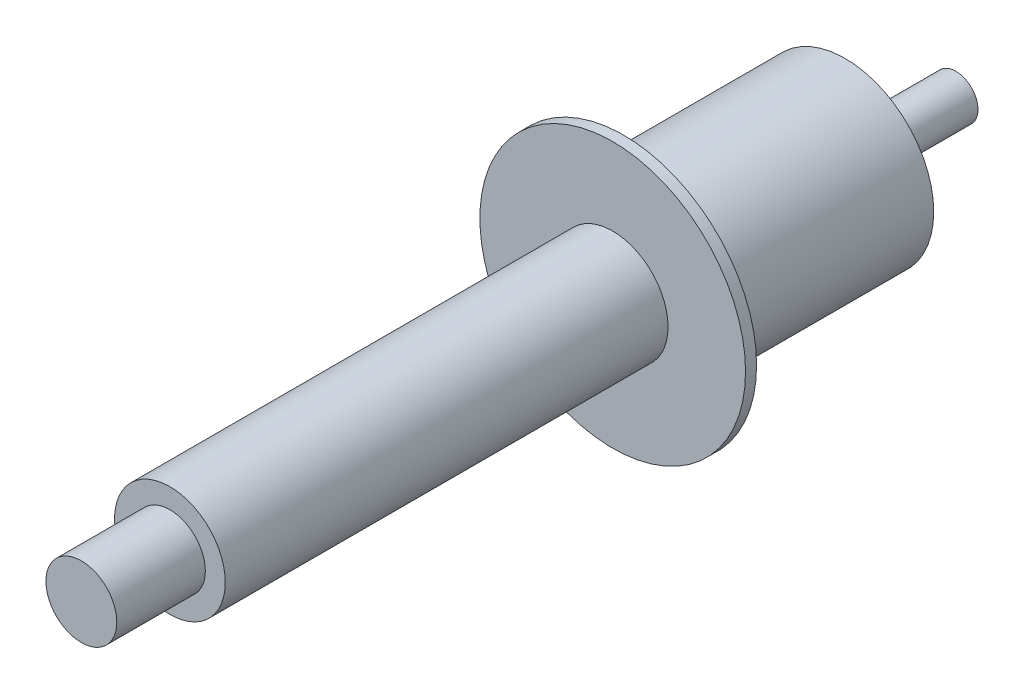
from build123d import *

# Parameters (mm, degrees)
SKIZZE1_R               = 5
LINEAR_AUSTRAGEN1_DEPTH = 20
SKIZZE2_R               = 10
LINEAR_AUSTRAGEN2_DEPTH = 5
SKIZZE3_R               = 20
LINEAR_AUSTRAGEN3_DEPTH = 50
SKIZZE4_R               = 30
LINEAR_AUSTRAGEN4_DEPTH = 2.5
SKIZZE5_R               = 12.5
LINEAR_AUSTRAGEN5_DEPTH = 100
SKIZZE6_R               = 8
LINEAR_AUSTRAGEN6_DEPTH = 20


with BuildPart() as part:
    # Skizze1 → Linear austragen1 (new body)
    with BuildSketch(Plane.XY):
        Circle(SKIZZE1_R)
    extrude(amount=LINEAR_AUSTRAGEN1_DEPTH)

    # Skizze2 → Linear austragen2 (add)
    with BuildSketch(Plane.XY.offset(20)):
        Circle(SKIZZE2_R)
    extrude(amount=LINEAR_AUSTRAGEN2_DEPTH)

    # Skizze3 → Linear austragen3 (add)
    with BuildSketch(Plane.XY.offset(25)):
        Circle(SKIZZE3_R)
    extrude(amount=LINEAR_AUSTRAGEN3_DEPTH)

    # Skizze4 → Linear austragen4 (add)
    with BuildSketch(Plane.XY.offset(75)):
        Circle(SKIZZE4_R)
    extrude(amount=LINEAR_AUSTRAGEN4_DEPTH)

    # Skizze5 → Linear austragen5 (add)
    with BuildSketch(Plane.XY.offset(77.5)):
        Circle(SKIZZE5_R)
    extrude(amount=LINEAR_AUSTRAGEN5_DEPTH)

    # Skizze6 → Linear austragen6 (add)
    with BuildSketch(Plane.XY.offset(177.5)):
        Circle(SKIZZE6_R)
    extrude(amount=LINEAR_AUSTRAGEN6_DEPTH)


solid = part.part
